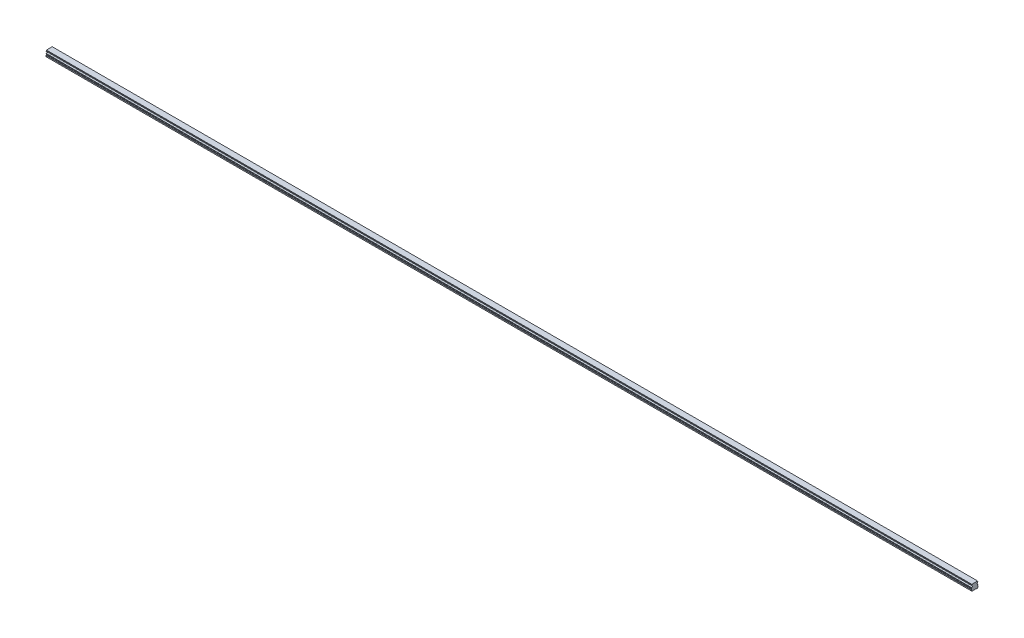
from build123d import *

# Parameters (mm, degrees)
BOSS_EXTRUDE1_DEPTH        = 2100
SKETCH3_R                  = 2.5
SKETCH3_R_2                = 2.1
CUT_EXTRUDE3_DEPTH         = 7
SKETCH3_2_R                = 2.1
CUT_EXTRUDE4_DEPTH         = 9.5
CHAMFER1_SIZE              = 0.4
LPATTERN2_COUNT            = 35
LPATTERN2_PITCH            = 60
CHAMFER1_OF_LPATTERN2_SIZE = 0.4


with BuildPart() as part:
    # Sketch1 → Boss-Extrude1 (new body)
    with BuildSketch(Plane(origin=(0, 0, 0), x_dir=(0, 0, -1), z_dir=(1, 0, 0))):
        with BuildLine():
            Line((6.59, 14), (-6.59, 14))
            Line((-6.59, 14), (-6.59, 13.15))
            Line((-6.59, 13.15), (-6.96, 12.356532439))
            Line((-6.96, 12.356532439), (-6.96, 11.435174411))
            ThreePointArc((-6.96, 11.435174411), (-5.25, 9.5), (-6.96, 7.564825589))
            Line((-6.96, 7.564825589), (-6.96, 6.643467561))
            Line((-6.96, 6.643467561), (-6.59, 5.85))
            Line((-6.59, 5.85), (-7.032116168, 4.2))
            Line((-7.032116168, 4.2), (-7.5, 3.929867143))
            Line((-7.5, 3.929867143), (-7.5, 1.4))
            Line((-7.5, 1.4), (-6.1, 0))
            Line((-6.1, 0), (-3.65, 0))
            Line((-3.65, 0), (-3.25, 0.4))
            Line((-3.25, 0.4), (3.25, 0.4))
            Line((3.25, 0.4), (3.65, 0))
            Line((3.65, 0), (6.1, 0))
            Line((6.1, 0), (7.5, 1.4))
            Line((7.5, 1.4), (7.5, 3.929867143))
            Line((7.5, 3.929867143), (7.032116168, 4.2))
            Line((7.032116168, 4.2), (6.59, 5.85))
            Line((6.59, 5.85), (6.96, 6.643467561))
            Line((6.96, 6.643467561), (6.96, 7.564825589))
            ThreePointArc((6.96, 7.564825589), (5.25, 9.5), (6.96, 11.435174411))
            Line((6.96, 11.435174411), (6.96, 12.356532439))
            Line((6.96, 12.356532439), (6.59, 13.15))
            Line((6.59, 13.15), (6.59, 14))
        make_face()
    extrude(amount=BOSS_EXTRUDE1_DEPTH)

    # Sketch3 → Cut-Extrude3 (cut)
    with BuildSketch(Plane.XZ):
        with Locations(Location((30, 0, 0), (0, 0, 270))):
            Circle(SKETCH3_R)
        with Locations(Location((30, 0, 0), (0, 0, 270))):
            Circle(SKETCH3_R_2, mode=Mode.SUBTRACT)
    cut_extrude3 = extrude(amount=-CUT_EXTRUDE3_DEPTH, mode=Mode.SUBTRACT)

    # Sketch3_2 → Cut-Extrude4 (cut)
    with BuildSketch(Plane.XZ):
        with Locations(Location((30, 0, 0), (0, 0, 270))):
            Circle(SKETCH3_2_R)
    cut_extrude4 = extrude(amount=-CUT_EXTRUDE4_DEPTH, mode=Mode.SUBTRACT)

    # Cut-Extrude5 cone 1 section (on through the dimple's axis) → Cut-Extrude5 (revolve, cut)
    with BuildSketch(Plane(origin=(30, 9.5, 0), x_dir=(0, 0, -1), z_dir=(1, 0, 0))):
        Polygon((0, 0), (2.1, 0), (0, 1.212435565), align=None)
    revolve(axis=Axis((30, 9.5, 0), (0, 1, 0)), mode=Mode.SUBTRACT)

    # Chamfer1
    chamfer1_edges = [part.edges().sort_by_distance(p)[0] for p in [
        (30, 0.4, 2.5),
    ]]
    chamfer(chamfer1_edges, length=CHAMFER1_SIZE)

    # LPattern2: Cut-Extrude3, Cut-Extrude4 ×35
    with Locations(*[(i * LPATTERN2_PITCH, 0, 0) for i in range(1, LPATTERN2_COUNT)]):
        add(cut_extrude3, mode=Mode.SUBTRACT)
        add(cut_extrude4, mode=Mode.SUBTRACT)

    # Chamfer1 of LPattern2
    chamfer1_of_lpattern2_edges = [part.edges().sort_by_distance(p)[0] for p in [
        (90, 0.4, 2.5),
        (150, 0.4, 2.5),
        (210, 0.4, 2.5),
        (270, 0.4, 2.5),
        (330, 0.4, 2.5),
        (390, 0.4, 2.5),
        (450, 0.4, 2.5),
        (510, 0.4, 2.5),
        (570, 0.4, 2.5),
        (630, 0.4, 2.5),
        (690, 0.4, 2.5),
        (750, 0.4, 2.5),
        (810, 0.4, 2.5),
        (870, 0.4, 2.5),
        (930, 0.4, 2.5),
        (990, 0.4, 2.5),
        (1050, 0.4, 2.5),
        (1110, 0.4, 2.5),
        (1170, 0.4, 2.5),
        (1230, 0.4, 2.5),
        (1290, 0.4, 2.5),
        (1350, 0.4, 2.5),
        (1410, 0.4, 2.5),
        (1470, 0.4, 2.5),
        (1530, 0.4, 2.5),
        (1590, 0.4, 2.5),
        (1650, 0.4, 2.5),
        (1710, 0.4, 2.5),
        (1770, 0.4, 2.5),
        (1830, 0.4, 2.5),
        (1890, 0.4, 2.5),
        (1950, 0.4, 2.5),
        (2010, 0.4, 2.5),
        (2070, 0.4, 2.5),
    ]]
    chamfer(chamfer1_of_lpattern2_edges, length=CHAMFER1_OF_LPATTERN2_SIZE)


solid = part.part
